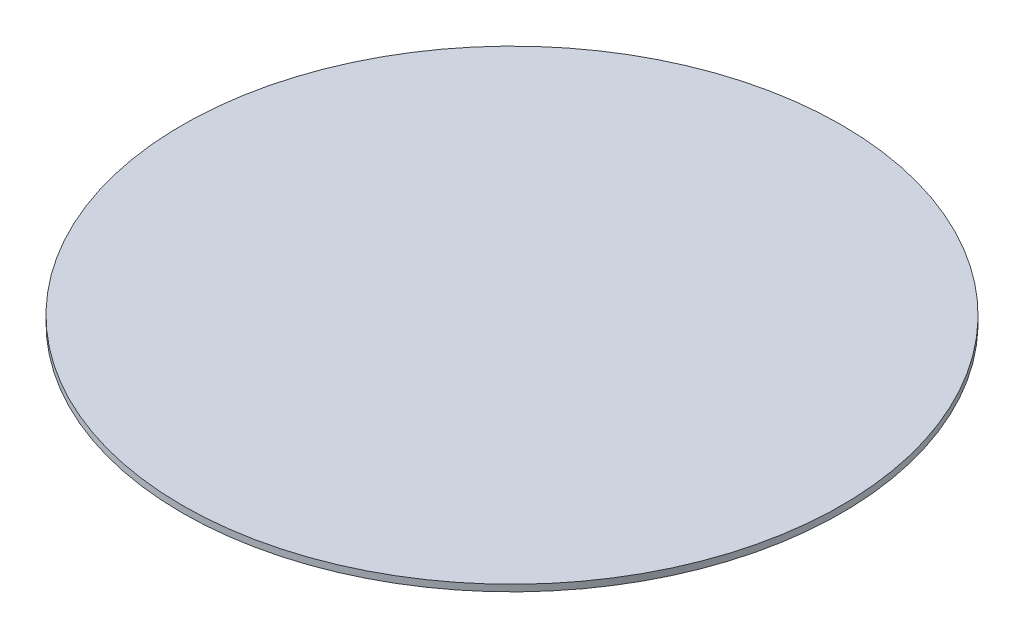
from build123d import *

# Parameters (mm, degrees)
SKETCH1_W      = 100
SKETCH1_H      = 100
EXTRUDE1_DEPTH = 1
EXTRUDE3_DEPTH = 142.424891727


with BuildPart() as part:
    # Sketch1 → Extrude1 (new body)
    with BuildSketch(Plane(origin=(0, 0, 0), x_dir=(1, 0, 0), z_dir=(0, 1, 0))):
        with Locations((50, 50)):
            Rectangle(SKETCH1_W, SKETCH1_H)
    extrude(amount=EXTRUDE1_DEPTH)

    # Sketch4 → Extrude3 (cut, through all)
    with BuildSketch(Plane(origin=(0, 1, 0), x_dir=(1, 0, 0), z_dir=(0, 1, 0))):
        with BuildLine():
            Line((50, 100), (0, 100))
            Line((0, 100), (0, 50))
            ThreePointArc((0, 50), (14.644660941, 85.355339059), (50, 100))
        make_face()
        with BuildLine():
            ThreePointArc((50, 0), (14.644660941, 14.644660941), (0, 50))
            Line((0, 50), (0, 0))
            Line((0, 0), (50, 0))
        make_face()
        with BuildLine():
            Line((100, 0), (100, 50))
            ThreePointArc((100, 50), (85.355339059, 14.644660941), (50, 0))
            Line((50, 0), (100, 0))
        make_face()
        with BuildLine():
            Line((100, 100), (50, 100))
            ThreePointArc((50, 100), (85.355339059, 85.355339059), (100, 50))
            Line((100, 50), (100, 100))
        make_face()
    extrude(amount=-EXTRUDE3_DEPTH, mode=Mode.SUBTRACT)


solid = part.part
